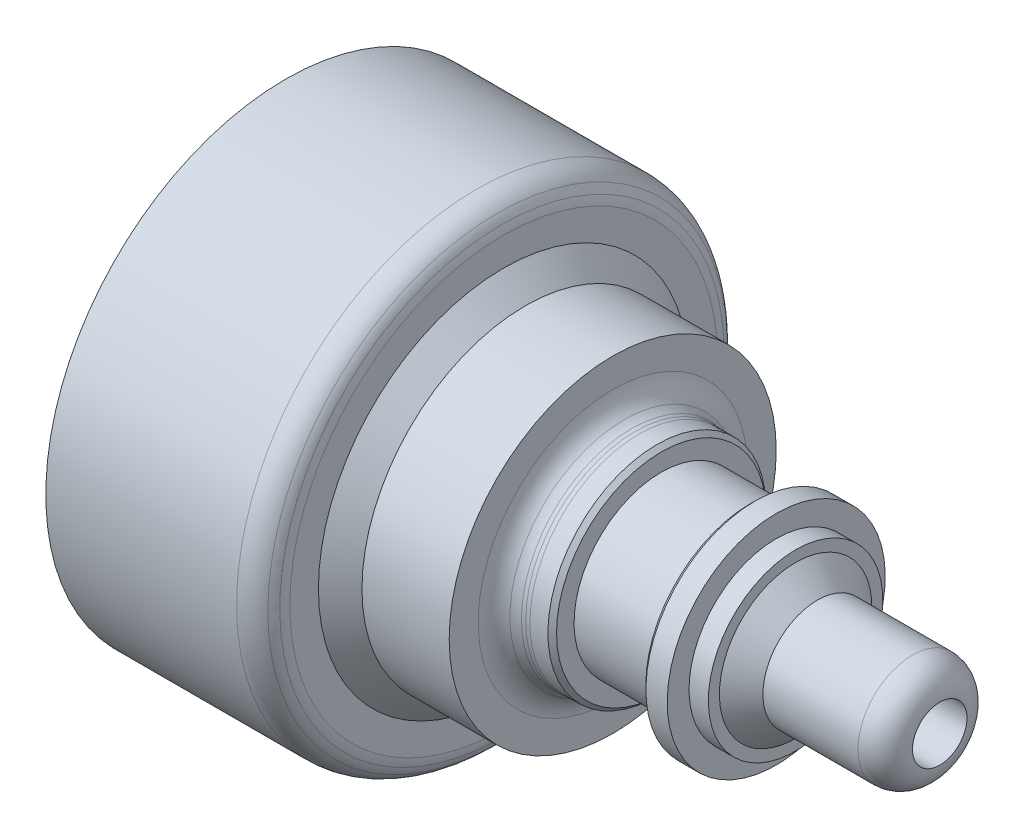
from build123d import *

# Parameters (mm, degrees)
SKETCH5_R          = 3.175
CUT_EXTRUDE1_DEPTH = 12.7


with BuildPart() as part:
    # Sketch1 → Revolve1 (revolve)
    with BuildSketch(Plane.XY):
        with BuildLine():
            Line((-76.199999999, 27.94), (-76.199999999, 0))
            Line((-76.199999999, 0), (-1e-09, 0))
            Line((-1e-09, 0), (-1e-09, 3.166571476))
            ThreePointArc((-1e-09, 3.166571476), (-0.930853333, 5.413211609), (-3.175, 6.350060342))
            Line((-3.175, 6.350060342), (-14.25448, 6.350060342))
            Line((-14.25448, 6.350060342), (-16.79448, 8.877376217))
            Line((-16.79448, 8.877376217), (-16.79448, 10.160032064))
            Line((-16.79448, 10.160032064), (-19.05, 10.160032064))
            Line((-19.05, 10.160032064), (-19.05, 12.7))
            Line((-19.05, 12.7), (-21.53158, 12.7))
            Line((-21.53158, 12.7), (-22.03958, 12.204620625))
            Line((-22.03958, 12.204620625), (-22.03958, 10.16))
            Line((-22.03958, 10.16), (-32.44342, 10.16))
            Line((-32.44342, 10.16), (-32.44342, 12.204311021))
            Line((-32.44342, 12.204311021), (-32.95142, 12.7))
            Line((-32.95142, 12.7), (-35.039182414, 12.706355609))
            ThreePointArc((-35.039182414, 12.706355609), (-35.259285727, 12.724553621), (-35.476407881, 12.764983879))
            ThreePointArc((-35.476407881, 12.764983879), (-35.681413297, 12.79665093), (-35.881203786, 12.852452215))
            ThreePointArc((-35.881203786, 12.852452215), (-36.345680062, 13.039800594), (-36.77314784, 13.300777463))
            ThreePointArc((-36.77314784, 13.300777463), (-37.697649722, 14.340070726), (-38.1, 15.671591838))
            Line((-38.1, 15.671591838), (-38.1, 19.05))
            Line((-38.1, 19.05), (-48.26, 19.05))
            Line((-48.26, 19.05), (-50.8, 21.582525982))
            Line((-50.8, 21.582525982), (-50.8, 24.913373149))
            ThreePointArc((-50.8, 24.913373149), (-50.872168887, 25.400279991), (-51.005742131, 25.874036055))
            ThreePointArc((-51.005742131, 25.874036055), (-51.222120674, 26.337502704), (-51.511403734, 26.759327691))
            ThreePointArc((-51.511403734, 26.759327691), (-52.611330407, 27.624827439), (-53.975, 27.94))
            Line((-53.975, 27.94), (-76.199999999, 27.94))
        make_face()
    revolve(axis=Axis((-76.199999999, 0, 0), (1, 0, 0)))

    # Sketch5 → Cut-Extrude1 (cut)
    with BuildSketch(Plane(origin=(0, 0, 0), x_dir=(0, 0, -1), z_dir=(1, 0, 0))):
        with Locations(Location((0, 0, 0), (0, 0, 90))):
            Circle(SKETCH5_R)
    extrude(amount=-CUT_EXTRUDE1_DEPTH, mode=Mode.SUBTRACT)


solid = part.part
